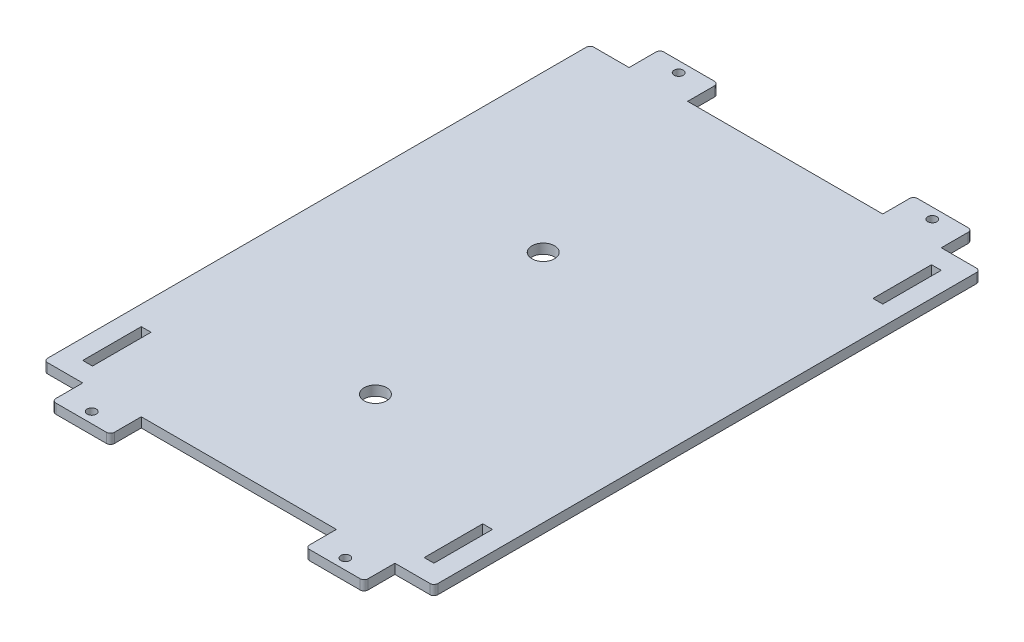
from build123d import *

# Parameters (mm, degrees)
SKETCH1_W             = 127
SKETCH1_H             = 177.8
BOSS_EXTRUDE1_DEPTH   = 3.175
SKETCH2_W             = 19.05
SKETCH2_H             = 10.033
BOSS_EXTRUDE2_DEPTH   = 3.175
SKETCH3_W             = 3.175
SKETCH3_H             = 19.05
CUT_EXTRUDE1_DEPTH    = 3.175
SKETCH4_R             = 3.683
CUT_EXTRUDE2_DEPTH    = 227.760482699
F_4_CLEARANCE_HOLE1_D = 2.9464
FILLET1_R             = 1.27


with BuildPart() as part:
    # Sketch1 → Boss-Extrude1 (new body)
    with BuildSketch(Plane(origin=(0, 0, 0), x_dir=(1, 0, 0), z_dir=(0, 1, 0))):
        with Locations((63.5, 88.9)):
            Rectangle(SKETCH1_W, SKETCH1_H)
    extrude(amount=BOSS_EXTRUDE1_DEPTH)

    # Sketch2 → Boss-Extrude2 (add)
    with BuildSketch(Plane(origin=(0, 0, 0), x_dir=(1, 0, 0), z_dir=(0, 1, 0))):
        with Locations((22.225, 182.8165)):
            Rectangle(SKETCH2_W, SKETCH2_H)
        with Locations((104.775, 182.8165)):
            Rectangle(SKETCH2_W, SKETCH2_H)
        with Locations((104.775, -5.0165)):
            Rectangle(SKETCH2_W, SKETCH2_H)
        with Locations((22.225, -5.0165)):
            Rectangle(SKETCH2_W, SKETCH2_H)
    extrude(amount=BOSS_EXTRUDE2_DEPTH)

    # Sketch3 → Cut-Extrude1 (cut)
    with BuildSketch(Plane(origin=(0, 3.175, 0), x_dir=(1, 0, 0), z_dir=(0, 1, 0))):
        with Locations((119.0625, 161.925)):
            Rectangle(SKETCH3_W, SKETCH3_H)
        with Locations((119.0625, 15.875)):
            Rectangle(SKETCH3_W, SKETCH3_H)
        with Locations((7.9375, 15.875)):
            Rectangle(SKETCH3_W, SKETCH3_H)
    extrude(amount=-CUT_EXTRUDE1_DEPTH, mode=Mode.SUBTRACT)

    # Sketch4 → Cut-Extrude2 (cut, through all)
    with BuildSketch(Plane(origin=(0, 3.175, 0), x_dir=(1, 0, 0), z_dir=(0, 1, 0))):
        with Locations(Location((50.8, 111.76, 0), (0, 0, 270))):
            Circle(SKETCH4_R)
        with Locations(Location((63.5, 44.45, 0), (0, 0, 270))):
            Circle(SKETCH4_R)
    extrude(amount=-CUT_EXTRUDE2_DEPTH, mode=Mode.SUBTRACT)

    # 4 Clearance Hole1 (through all)
    with Locations(Plane(origin=(0, 3.175, 0), x_dir=(1, 0, 0), z_dir=(0, 1, 0))):
        with Locations((22.225, 184.404), (104.775, 184.404), (22.225, -6.604), (104.775, -6.604)):
            Hole(F_4_CLEARANCE_HOLE1_D / 2)

    # Fillet1
    fillet1_edges = [part.edges().sort_by_distance(p)[0] for p in [
        (0, 1.5875, 0),
        (12.7, 1.5875, 10.033),
        (31.75, 1.5875, 10.033),
        (95.25, 1.5875, 10.033),
        (114.3, 1.5875, 10.033),
        (127, 1.5875, 0),
        (127, 1.5875, -177.8),
        (114.3, 1.5875, -187.833),
        (95.25, 1.5875, -187.833),
        (0, 1.5875, -177.8),
        (31.75, 1.5875, -187.833),
        (12.7, 1.5875, -187.833),
    ]]
    fillet(fillet1_edges, radius=FILLET1_R)


solid = part.part
